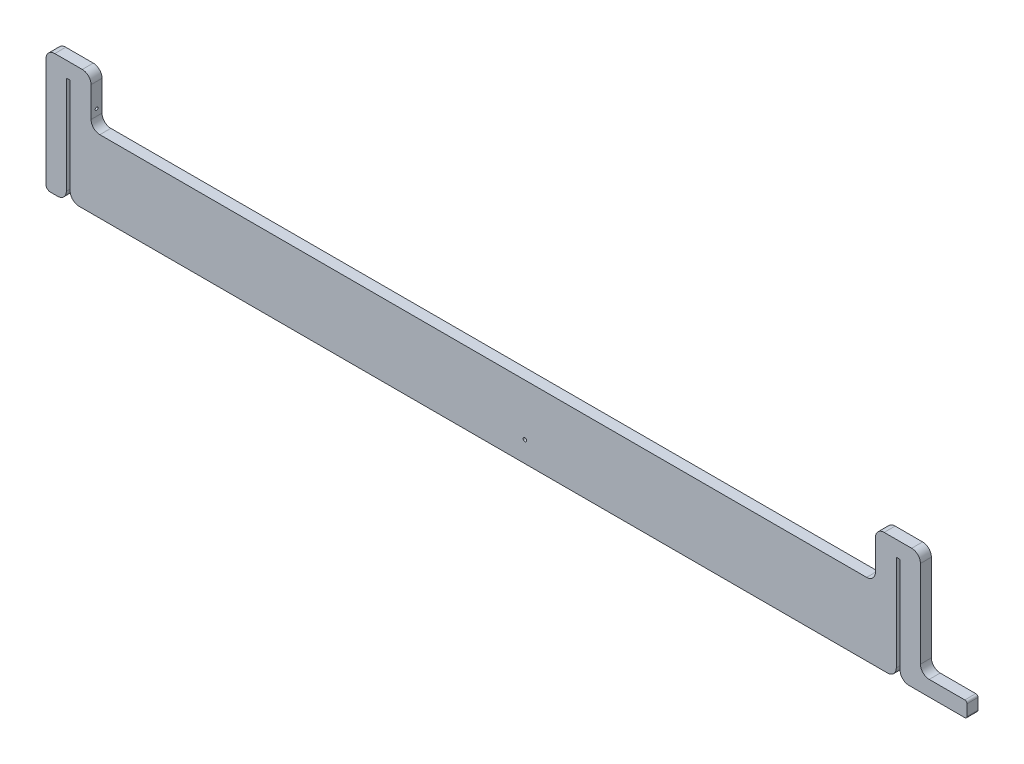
from build123d import *

# Parameters (mm, degrees)
BOSS_EXTRUDE1_DEPTH = 7.9375
SKETCH6_R           = 2.0193
CUT_EXTRUDE3_DEPTH  = 30.48
CUT_EXTRUDE4_START  = -30.48
SKETCH7_R           = 2.0193
CUT_EXTRUDE4_DEPTH  = 30.48
SKETCH8_R           = 2.54
CUT_EXTRUDE5_DEPTH  = 12.7


with BuildPart() as part:
    # Sketch3 → Boss-Extrude1 (new, symmetric)
    with BuildSketch(Plane.XY):
        with BuildLine():
            Line((-584.99375, 3.175), (584.99375, 3.175))
            ThreePointArc((584.99375, 3.175), (593.974006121, 6.894743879), (597.69375, 15.875))
            Line((597.69375, 15.875), (597.69375, 153.19375))
            ThreePointArc((597.69375, 153.19375), (598.158717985, 154.316282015), (599.28125, 154.78125))
            Line((599.28125, 154.78125), (601.6625, 154.78125))
            ThreePointArc((601.6625, 154.78125), (602.785032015, 154.316282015), (603.25, 153.19375))
            Line((603.25, 153.19375), (603.25, 15.875))
            ThreePointArc((603.25, 15.875), (606.969743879, 6.894743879), (615.95, 3.175))
            Line((615.95, 3.175), (696.9125, 3.175))
            ThreePointArc((696.9125, 3.175), (699.15756403, 4.10493597), (700.0875, 6.35))
            Line((700.0875, 6.35), (700.0875, 22.225))
            ThreePointArc((700.0875, 22.225), (699.15756403, 24.47006403), (696.9125, 25.4))
            Line((696.9125, 25.4), (645.3632, 25.4))
            ThreePointArc((645.3632, 25.4), (636.382943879, 29.119743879), (632.6632, 38.1))
            Line((632.6632, 38.1), (632.6632, 164.30625))
            ThreePointArc((632.6632, 164.30625), (628.943456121, 173.286506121), (619.9632, 177.00625))
            Line((619.9632, 177.00625), (580.16775, 177.00625))
            ThreePointArc((580.16775, 177.00625), (571.187493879, 173.286506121), (567.46775, 164.30625))
            Line((567.46775, 164.30625), (567.46775, 120.65))
            ThreePointArc((567.46775, 120.65), (563.748006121, 111.669743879), (554.76775, 107.95))
            Line((554.76775, 107.95), (-554.76775, 107.95))
            ThreePointArc((-554.76775, 107.95), (-563.748006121, 111.669743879), (-567.46775, 120.65))
            Line((-567.46775, 120.65), (-567.46775, 164.30625))
            ThreePointArc((-567.46775, 164.30625), (-571.187493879, 173.286506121), (-580.16775, 177.00625))
            Line((-580.16775, 177.00625), (-619.9632, 177.00625))
            ThreePointArc((-619.9632, 177.00625), (-628.943456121, 173.286506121), (-632.6632, 164.30625))
            Line((-632.6632, 164.30625), (-632.6632, 6.5484375))
            ThreePointArc((-632.6632, 6.5484375), (-630.803328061, 2.058309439), (-626.3132, 0.1984375))
            Line((-626.3132, 0.1984375), (-615.95, 0.1984375))
            ThreePointArc((-615.95, 0.1984375), (-606.969743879, 3.918181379), (-603.25, 12.8984375))
            Line((-603.25, 12.8984375), (-603.25, 153.19375))
            ThreePointArc((-603.25, 153.19375), (-602.785032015, 154.316282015), (-601.6625, 154.78125))
            Line((-601.6625, 154.78125), (-599.28125, 154.78125))
            ThreePointArc((-599.28125, 154.78125), (-598.158717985, 154.316282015), (-597.69375, 153.19375))
            Line((-597.69375, 153.19375), (-597.69375, 15.875))
            ThreePointArc((-597.69375, 15.875), (-593.974006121, 6.894743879), (-584.99375, 3.175))
        make_face()
    extrude(amount=BOSS_EXTRUDE1_DEPTH, both=True)

    # Sketch6 → Cut-Extrude3 (cut)
    with BuildSketch(Plane.ZY.offset(-567.46775)):
        with Locations(Location((0, 130.175, 0), (0, 0, 270))):
            Circle(SKETCH6_R)
    extrude(amount=-CUT_EXTRUDE3_DEPTH, mode=Mode.SUBTRACT)

    # Sketch7 → Cut-Extrude4 (cut)
    with BuildSketch(Plane(origin=(-567.46775, 0, 0), x_dir=(0, 0, -1), z_dir=(1, 0, 0)).offset(CUT_EXTRUDE4_START)):
        with Locations(Location((0, 130.175, 0), (0, 0, 270))):
            Circle(SKETCH7_R)
    extrude(amount=CUT_EXTRUDE4_DEPTH, mode=Mode.SUBTRACT)

    # Sketch8 → Cut-Extrude5 (cut, symmetric)
    with BuildSketch(Plane.XY):
        with Locations(Location((60.325, 33.3375, 0), (0, 0, 180))):
            Circle(SKETCH8_R)
    extrude(amount=CUT_EXTRUDE5_DEPTH, both=True, mode=Mode.SUBTRACT)


solid = part.part
